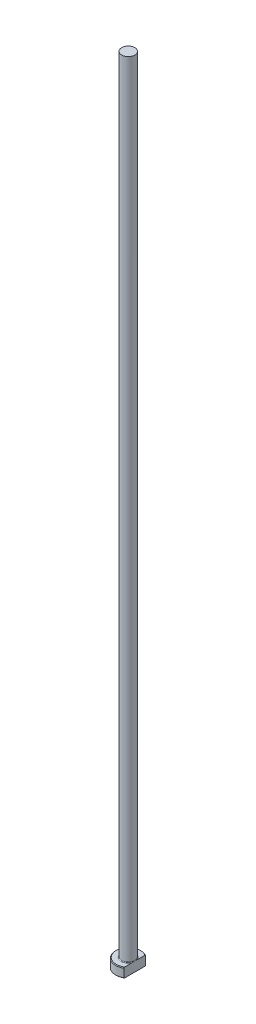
from build123d import *
from build123d.topology import SkipClean

# Parameters (mm, degrees)
CHAMFER1_SIZE = 0.2
FILLET1_R     = 0.2
KEY_DEPTH     = 251.06399181


with BuildPart() as part:
    # Sketch1 → Revolve1 (revolve)
    with BuildSketch(Plane.XY, mode=Mode.PRIVATE) as revolve1_sk:
        Polygon((0, 0), (-4, 0), (-4, 3), (-2.05, 3), (-2.05, 250), (0, 250), align=None)
    revolve(revolve1_sk.sketch.rotate(Axis((0, 259.958771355, 0), (0, -1, 0)), 270), axis=Axis((0, 259.958771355, 0), (0, -1, 0)))

    # Chamfer1
    chamfer1_edges = [part.edges().sort_by_distance(p)[0] for p in [
        (0, 3, -4),
        (0, 0, -4),
    ]]
    chamfer(chamfer1_edges, length=CHAMFER1_SIZE)

    # Fillet1
    fillet1_edges = [part.edges().sort_by_distance(p)[0] for p in [
        (0, 3, -2.05),
    ]]
    fillet(fillet1_edges, radius=FILLET1_R)

    # Sketch2 → KEY (cut, through all)
    with SkipClean():  # the faces are left unmerged after this step: merging them gives an invalid solid
        with BuildSketch(Plane(origin=(0, 0, 0), x_dir=(1, 0, 0), z_dir=(0, 1, 0))):
            with BuildLine():
                Line((2.05, 3.434748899), (2.05, -3.434748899))
                ThreePointArc((2.05, -3.434748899), (4, 0), (2.05, 3.434748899))
            make_face()
        extrude(amount=KEY_DEPTH, mode=Mode.SUBTRACT)


solid = part.part
